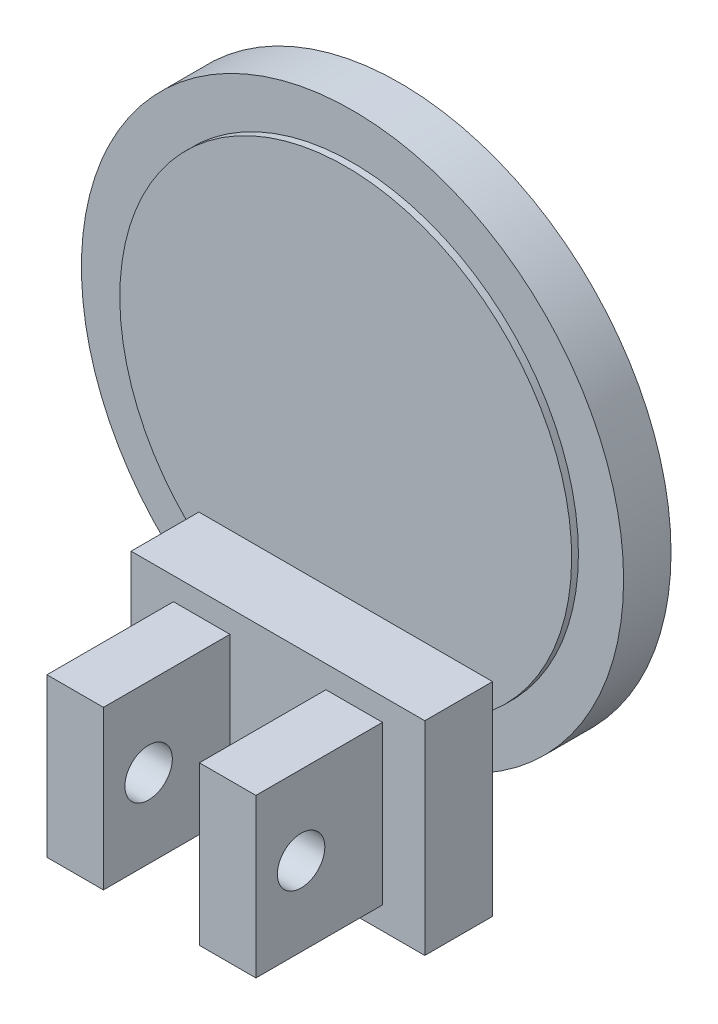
ISO-10303-21;
HEADER;
FILE_DESCRIPTION(('STEP AP214'),'2;1');
FILE_NAME('part.step','',(''),(''),'','','');
FILE_SCHEMA(('AUTOMOTIVE_DESIGN { 1 0 10303 214 1 1 1 1 }'));
ENDSEC;
DATA;
#1=APPLICATION_CONTEXT('core data for automotive mechanical design processes');
#2=APPLICATION_PROTOCOL_DEFINITION('international standard','automotive_design',2000,#1);
#3=PRODUCT_CONTEXT('',#1,'mechanical');
#4=PRODUCT('Part','Part','',(#3));
#5=PRODUCT_RELATED_PRODUCT_CATEGORY('part','',(#4));
#6=PRODUCT_DEFINITION_FORMATION('','',#4);
#7=PRODUCT_DEFINITION_CONTEXT('part definition',#1,'design');
#8=PRODUCT_DEFINITION('design','',#6,#7);
#9=PRODUCT_DEFINITION_SHAPE('','',#8);
#10=(LENGTH_UNIT() NAMED_UNIT(*) SI_UNIT(.MILLI.,.METRE.));
#11=(NAMED_UNIT(*) PLANE_ANGLE_UNIT() SI_UNIT($,.RADIAN.));
#12=(NAMED_UNIT(*) SI_UNIT($,.STERADIAN.) SOLID_ANGLE_UNIT());
#13=UNCERTAINTY_MEASURE_WITH_UNIT(LENGTH_MEASURE(1.E-05),#10,'distance_accuracy_value','');
#14=(GEOMETRIC_REPRESENTATION_CONTEXT(3) GLOBAL_UNCERTAINTY_ASSIGNED_CONTEXT((#13)) GLOBAL_UNIT_ASSIGNED_CONTEXT((#10,
#11,#12)) REPRESENTATION_CONTEXT('',''));
#15=CARTESIAN_POINT('',(0.,0.,0.));
#16=DIRECTION('',(0.,0.,1.));
#17=DIRECTION('',(1.,0.,0.));
#18=AXIS2_PLACEMENT_3D('',#15,#16,#17);
#19=CARTESIAN_POINT('',(0.,0.,4.2));
#20=DIRECTION('',(0.,0.,-1.));
#21=DIRECTION('',(-1.,0.,0.));
#22=AXIS2_PLACEMENT_3D('',#19,#20,#21);
#23=CYLINDRICAL_SURFACE('',#22,24.);
#24=CARTESIAN_POINT('',(0.,0.,4.2));
#25=DIRECTION('',(0.,0.,1.));
#26=DIRECTION('',(1.,0.,0.));
#27=AXIS2_PLACEMENT_3D('',#24,#25,#26);
#28=CIRCLE('',#27,24.);
#29=CARTESIAN_POINT('',(24.,0.,4.2));
#30=VERTEX_POINT('',#29);
#31=EDGE_CURVE('E245',#30,#30,#28,.T.);
#32=ORIENTED_EDGE('',*,*,#31,.F.);
#33=EDGE_LOOP('',(#32));
#34=FACE_BOUND('',#33,.T.);
#35=CARTESIAN_POINT('',(0.,0.,0.));
#36=DIRECTION('',(0.,0.,1.));
#37=DIRECTION('',(1.,0.,0.));
#38=AXIS2_PLACEMENT_3D('',#35,#36,#37);
#39=CIRCLE('',#38,24.);
#40=CARTESIAN_POINT('',(24.,0.,0.));
#41=VERTEX_POINT('',#40);
#42=EDGE_CURVE('E241',#41,#41,#39,.T.);
#43=ORIENTED_EDGE('',*,*,#42,.T.);
#44=EDGE_LOOP('',(#43));
#45=FACE_BOUND('',#44,.T.);
#46=ADVANCED_FACE('F39',(#34,#45),#23,.T.);
#47=CARTESIAN_POINT('',(0.,0.,4.2));
#48=DIRECTION('',(0.,0.,1.));
#49=DIRECTION('',(1.,0.,0.));
#50=AXIS2_PLACEMENT_3D('',#47,#48,#49);
#51=PLANE('',#50);
#52=CARTESIAN_POINT('',(0.,0.,4.2));
#53=DIRECTION('',(0.,0.,1.));
#54=DIRECTION('',(1.,0.,0.));
#55=AXIS2_PLACEMENT_3D('',#52,#53,#54);
#56=CIRCLE('',#55,20.);
#57=CARTESIAN_POINT('',(20.,0.,4.2));
#58=VERTEX_POINT('',#57);
#59=EDGE_CURVE('E242',#58,#58,#56,.T.);
#60=ORIENTED_EDGE('',*,*,#59,.F.);
#61=EDGE_LOOP('',(#60));
#62=FACE_BOUND('',#61,.T.);
#63=ORIENTED_EDGE('',*,*,#31,.T.);
#64=EDGE_LOOP('',(#63));
#65=FACE_BOUND('',#64,.T.);
#66=ADVANCED_FACE('F315',(#62,#65),#51,.T.);
#67=CARTESIAN_POINT('',(0.,0.,0.));
#68=DIRECTION('',(0.,0.,1.));
#69=DIRECTION('',(1.,0.,0.));
#70=AXIS2_PLACEMENT_3D('',#67,#68,#69);
#71=PLANE('',#70);
#72=ORIENTED_EDGE('',*,*,#42,.F.);
#73=EDGE_LOOP('',(#72));
#74=FACE_BOUND('',#73,.T.);
#75=ADVANCED_FACE('F320',(#74),#71,.F.);
#76=CARTESIAN_POINT('',(0.,0.,4.8));
#77=DIRECTION('',(0.,0.,-1.));
#78=DIRECTION('',(-1.,0.,0.));
#79=AXIS2_PLACEMENT_3D('',#76,#77,#78);
#80=CYLINDRICAL_SURFACE('',#79,20.);
#81=CARTESIAN_POINT('',(0.,0.,4.8));
#82=DIRECTION('',(0.,0.,1.));
#83=DIRECTION('',(1.,0.,0.));
#84=AXIS2_PLACEMENT_3D('',#81,#82,#83);
#85=CIRCLE('',#84,20.);
#86=CARTESIAN_POINT('',(-13.,-15.1986841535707,4.8));
#87=VERTEX_POINT('',#86);
#88=CARTESIAN_POINT('',(13.,-15.1986841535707,4.8));
#89=VERTEX_POINT('',#88);
#90=EDGE_CURVE('E239',#87,#89,#85,.T.);
#91=ORIENTED_EDGE('',*,*,#90,.F.);
#92=EDGE_CURVE('E233',#89,#87,#85,.T.);
#93=ORIENTED_EDGE('',*,*,#92,.F.);
#94=EDGE_LOOP('',(#91,#93));
#95=FACE_BOUND('',#94,.T.);
#96=ORIENTED_EDGE('',*,*,#59,.T.);
#97=EDGE_LOOP('',(#96));
#98=FACE_BOUND('',#97,.T.);
#99=ADVANCED_FACE('F297',(#95,#98),#80,.T.);
#100=CARTESIAN_POINT('',(0.,0.,4.8));
#101=DIRECTION('',(0.,0.,1.));
#102=DIRECTION('',(1.,0.,0.));
#103=AXIS2_PLACEMENT_3D('',#100,#101,#102);
#104=PLANE('',#103);
#105=DIRECTION('',(0.,1.,0.));
#106=VECTOR('',#105,1.);
#107=CARTESIAN_POINT('',(13.,-31.,4.8));
#108=LINE('',#107,#106);
#109=CARTESIAN_POINT('',(13.,-13.,4.8));
#110=VERTEX_POINT('',#109);
#111=EDGE_CURVE('E11',#89,#110,#108,.T.);
#112=ORIENTED_EDGE('',*,*,#111,.F.);
#113=ORIENTED_EDGE('',*,*,#92,.T.);
#114=DIRECTION('',(0.,1.,0.));
#115=VECTOR('',#114,1.);
#116=CARTESIAN_POINT('',(-13.,-31.,4.8));
#117=LINE('',#116,#115);
#118=CARTESIAN_POINT('',(-13.,-13.,4.8));
#119=VERTEX_POINT('',#118);
#120=EDGE_CURVE('E47',#87,#119,#117,.T.);
#121=ORIENTED_EDGE('',*,*,#120,.T.);
#122=DIRECTION('',(-1.,0.,0.));
#123=VECTOR('',#122,1.);
#124=CARTESIAN_POINT('',(-13.,-13.,4.8));
#125=LINE('',#124,#123);
#126=EDGE_CURVE('E212',#110,#119,#125,.T.);
#127=ORIENTED_EDGE('',*,*,#126,.F.);
#128=EDGE_LOOP('',(#112,#113,#121,#127));
#129=FACE_BOUND('',#128,.T.);
#130=ADVANCED_FACE('F293',(#129),#104,.T.);
#131=CARTESIAN_POINT('',(-13.,-31.,10.8));
#132=DIRECTION('',(-1.,0.,0.));
#133=DIRECTION('',(0.,0.,1.));
#134=AXIS2_PLACEMENT_3D('',#131,#132,#133);
#135=PLANE('',#134);
#136=DIRECTION('',(0.,0.,1.));
#137=VECTOR('',#136,1.);
#138=CARTESIAN_POINT('',(-13.,-13.,10.8));
#139=LINE('',#138,#137);
#140=CARTESIAN_POINT('',(-13.,-13.,10.8));
#141=VERTEX_POINT('',#140);
#142=EDGE_CURVE('E202',#119,#141,#139,.T.);
#143=ORIENTED_EDGE('',*,*,#142,.F.);
#144=ORIENTED_EDGE('',*,*,#120,.F.);
#145=CARTESIAN_POINT('',(-13.,-31.,4.8));
#146=VERTEX_POINT('',#145);
#147=EDGE_CURVE('E231',#146,#87,#117,.T.);
#148=ORIENTED_EDGE('',*,*,#147,.F.);
#149=DIRECTION('',(0.,0.,1.));
#150=VECTOR('',#149,1.);
#151=CARTESIAN_POINT('',(-13.,-31.,10.8));
#152=LINE('',#151,#150);
#153=CARTESIAN_POINT('',(-13.,-31.,10.8));
#154=VERTEX_POINT('',#153);
#155=EDGE_CURVE('E208',#146,#154,#152,.T.);
#156=ORIENTED_EDGE('',*,*,#155,.T.);
#157=DIRECTION('',(0.,1.,0.));
#158=VECTOR('',#157,1.);
#159=CARTESIAN_POINT('',(-13.,-31.,10.8));
#160=LINE('',#159,#158);
#161=EDGE_CURVE('E221',#154,#141,#160,.T.);
#162=ORIENTED_EDGE('',*,*,#161,.T.);
#163=EDGE_LOOP('',(#143,#144,#148,#156,#162));
#164=FACE_BOUND('',#163,.T.);
#165=ADVANCED_FACE('F289',(#164),#135,.T.);
#166=CARTESIAN_POINT('',(-13.,-31.,4.8));
#167=DIRECTION('',(0.,0.,-1.));
#168=DIRECTION('',(-1.,0.,0.));
#169=AXIS2_PLACEMENT_3D('',#166,#167,#168);
#170=PLANE('',#169);
#171=ORIENTED_EDGE('',*,*,#147,.T.);
#172=ORIENTED_EDGE('',*,*,#90,.T.);
#173=CARTESIAN_POINT('',(13.,-31.,4.8));
#174=VERTEX_POINT('',#173);
#175=EDGE_CURVE('E49',#174,#89,#108,.T.);
#176=ORIENTED_EDGE('',*,*,#175,.F.);
#177=DIRECTION('',(-1.,0.,0.));
#178=VECTOR('',#177,1.);
#179=CARTESIAN_POINT('',(-13.,-31.,4.8));
#180=LINE('',#179,#178);
#181=EDGE_CURVE('E218',#174,#146,#180,.T.);
#182=ORIENTED_EDGE('',*,*,#181,.T.);
#183=EDGE_LOOP('',(#171,#172,#176,#182));
#184=FACE_BOUND('',#183,.T.);
#185=ADVANCED_FACE('F300',(#184),#170,.T.);
#186=CARTESIAN_POINT('',(13.,-31.,10.8));
#187=DIRECTION('',(1.,0.,0.));
#188=DIRECTION('',(0.,0.,-1.));
#189=AXIS2_PLACEMENT_3D('',#186,#187,#188);
#190=PLANE('',#189);
#191=DIRECTION('',(0.,0.,-1.));
#192=VECTOR('',#191,1.);
#193=CARTESIAN_POINT('',(13.,-13.,10.8));
#194=LINE('',#193,#192);
#195=CARTESIAN_POINT('',(13.,-13.,10.8));
#196=VERTEX_POINT('',#195);
#197=EDGE_CURVE('E227',#196,#110,#194,.T.);
#198=ORIENTED_EDGE('',*,*,#197,.F.);
#199=DIRECTION('',(0.,1.,0.));
#200=VECTOR('',#199,1.);
#201=CARTESIAN_POINT('',(13.,-31.,10.8));
#202=LINE('',#201,#200);
#203=CARTESIAN_POINT('',(13.,-31.,10.8));
#204=VERTEX_POINT('',#203);
#205=EDGE_CURVE('E236',#204,#196,#202,.T.);
#206=ORIENTED_EDGE('',*,*,#205,.F.);
#207=DIRECTION('',(0.,0.,-1.));
#208=VECTOR('',#207,1.);
#209=CARTESIAN_POINT('',(13.,-31.,10.8));
#210=LINE('',#209,#208);
#211=EDGE_CURVE('E215',#204,#174,#210,.T.);
#212=ORIENTED_EDGE('',*,*,#211,.T.);
#213=ORIENTED_EDGE('',*,*,#175,.T.);
#214=ORIENTED_EDGE('',*,*,#111,.T.);
#215=EDGE_LOOP('',(#198,#206,#212,#213,#214));
#216=FACE_BOUND('',#215,.T.);
#217=ADVANCED_FACE('F275',(#216),#190,.T.);
#218=CARTESIAN_POINT('',(-13.,-31.,10.8));
#219=DIRECTION('',(0.,0.,1.));
#220=DIRECTION('',(1.,0.,0.));
#221=AXIS2_PLACEMENT_3D('',#218,#219,#220);
#222=PLANE('',#221);
#223=DIRECTION('',(-1.,0.,0.));
#224=VECTOR('',#223,1.);
#225=CARTESIAN_POINT('',(-9.25,-29.,10.8));
#226=LINE('',#225,#224);
#227=CARTESIAN_POINT('',(-4.25,-29.,10.8));
#228=VERTEX_POINT('',#227);
#229=CARTESIAN_POINT('',(-9.25,-29.,10.8));
#230=VERTEX_POINT('',#229);
#231=EDGE_CURVE('E148',#228,#230,#226,.T.);
#232=ORIENTED_EDGE('',*,*,#231,.T.);
#233=DIRECTION('',(0.,1.,0.));
#234=VECTOR('',#233,1.);
#235=CARTESIAN_POINT('',(-9.25,-29.,10.8));
#236=LINE('',#235,#234);
#237=CARTESIAN_POINT('',(-9.25,-15.,10.8));
#238=VERTEX_POINT('',#237);
#239=EDGE_CURVE('E161',#230,#238,#236,.T.);
#240=ORIENTED_EDGE('',*,*,#239,.T.);
#241=DIRECTION('',(-1.,0.,0.));
#242=VECTOR('',#241,1.);
#243=CARTESIAN_POINT('',(-9.25,-15.,10.8));
#244=LINE('',#243,#242);
#245=CARTESIAN_POINT('',(-4.25,-15.,10.8));
#246=VERTEX_POINT('',#245);
#247=EDGE_CURVE('E162',#246,#238,#244,.T.);
#248=ORIENTED_EDGE('',*,*,#247,.F.);
#249=DIRECTION('',(0.,1.,0.));
#250=VECTOR('',#249,1.);
#251=CARTESIAN_POINT('',(-4.25,-29.,10.8));
#252=LINE('',#251,#250);
#253=EDGE_CURVE('E177',#228,#246,#252,.T.);
#254=ORIENTED_EDGE('',*,*,#253,.F.);
#255=EDGE_LOOP('',(#232,#240,#248,#254));
#256=FACE_BOUND('',#255,.T.);
#257=DIRECTION('',(-1.,0.,0.));
#258=VECTOR('',#257,1.);
#259=CARTESIAN_POINT('',(4.25,-29.,10.8));
#260=LINE('',#259,#258);
#261=CARTESIAN_POINT('',(9.24999999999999,-29.,10.8));
#262=VERTEX_POINT('',#261);
#263=CARTESIAN_POINT('',(4.25,-29.,10.8));
#264=VERTEX_POINT('',#263);
#265=EDGE_CURVE('E189',#262,#264,#260,.T.);
#266=ORIENTED_EDGE('',*,*,#265,.T.);
#267=DIRECTION('',(0.,1.,0.));
#268=VECTOR('',#267,1.);
#269=CARTESIAN_POINT('',(4.25,-29.,10.8));
#270=LINE('',#269,#268);
#271=CARTESIAN_POINT('',(4.25,-15.,10.8));
#272=VERTEX_POINT('',#271);
#273=EDGE_CURVE('E199',#264,#272,#270,.T.);
#274=ORIENTED_EDGE('',*,*,#273,.T.);
#275=DIRECTION('',(-1.,0.,0.));
#276=VECTOR('',#275,1.);
#277=CARTESIAN_POINT('',(4.25,-15.,10.8));
#278=LINE('',#277,#276);
#279=CARTESIAN_POINT('',(9.24999999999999,-15.,10.8));
#280=VERTEX_POINT('',#279);
#281=EDGE_CURVE('E184',#280,#272,#278,.T.);
#282=ORIENTED_EDGE('',*,*,#281,.F.);
#283=DIRECTION('',(0.,1.,0.));
#284=VECTOR('',#283,1.);
#285=CARTESIAN_POINT('',(9.24999999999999,-29.,10.8));
#286=LINE('',#285,#284);
#287=EDGE_CURVE('E203',#262,#280,#286,.T.);
#288=ORIENTED_EDGE('',*,*,#287,.F.);
#289=EDGE_LOOP('',(#266,#274,#282,#288));
#290=FACE_BOUND('',#289,.T.);
#291=DIRECTION('',(1.,0.,0.));
#292=VECTOR('',#291,1.);
#293=CARTESIAN_POINT('',(-13.,-13.,10.8));
#294=LINE('',#293,#292);
#295=EDGE_CURVE('E224',#141,#196,#294,.T.);
#296=ORIENTED_EDGE('',*,*,#295,.F.);
#297=ORIENTED_EDGE('',*,*,#161,.F.);
#298=DIRECTION('',(1.,0.,0.));
#299=VECTOR('',#298,1.);
#300=CARTESIAN_POINT('',(-13.,-31.,10.8));
#301=LINE('',#300,#299);
#302=EDGE_CURVE('E211',#154,#204,#301,.T.);
#303=ORIENTED_EDGE('',*,*,#302,.T.);
#304=ORIENTED_EDGE('',*,*,#205,.T.);
#305=EDGE_LOOP('',(#296,#297,#303,#304));
#306=FACE_BOUND('',#305,.T.);
#307=ADVANCED_FACE('F271',(#256,#290,#306),#222,.T.);
#308=CARTESIAN_POINT('',(0.,-31.,0.));
#309=DIRECTION('',(0.,-1.,0.));
#310=DIRECTION('',(0.,0.,-1.));
#311=AXIS2_PLACEMENT_3D('',#308,#309,#310);
#312=PLANE('',#311);
#313=ORIENTED_EDGE('',*,*,#155,.F.);
#314=ORIENTED_EDGE('',*,*,#181,.F.);
#315=ORIENTED_EDGE('',*,*,#211,.F.);
#316=ORIENTED_EDGE('',*,*,#302,.F.);
#317=EDGE_LOOP('',(#313,#314,#315,#316));
#318=FACE_BOUND('',#317,.T.);
#319=ADVANCED_FACE('F274',(#318),#312,.T.);
#320=CARTESIAN_POINT('',(0.,-13.,0.));
#321=DIRECTION('',(0.,-1.,0.));
#322=DIRECTION('',(0.,0.,-1.));
#323=AXIS2_PLACEMENT_3D('',#320,#321,#322);
#324=PLANE('',#323);
#325=ORIENTED_EDGE('',*,*,#142,.T.);
#326=ORIENTED_EDGE('',*,*,#295,.T.);
#327=ORIENTED_EDGE('',*,*,#197,.T.);
#328=ORIENTED_EDGE('',*,*,#126,.T.);
#329=EDGE_LOOP('',(#325,#326,#327,#328));
#330=FACE_BOUND('',#329,.T.);
#331=ADVANCED_FACE('F285',(#330),#324,.F.);
#332=CARTESIAN_POINT('',(4.25,-29.,22.));
#333=DIRECTION('',(-1.,0.,0.));
#334=DIRECTION('',(0.,0.,1.));
#335=AXIS2_PLACEMENT_3D('',#332,#333,#334);
#336=PLANE('',#335);
#337=CARTESIAN_POINT('',(4.25,-22.,18.));
#338=DIRECTION('',(-1.,0.,0.));
#339=DIRECTION('',(0.,0.,1.));
#340=AXIS2_PLACEMENT_3D('',#337,#338,#339);
#341=CIRCLE('',#340,2.1);
#342=CARTESIAN_POINT('',(4.25,-22.,20.1));
#343=VERTEX_POINT('',#342);
#344=EDGE_CURVE('E166',#343,#343,#341,.F.);
#345=ORIENTED_EDGE('',*,*,#344,.T.);
#346=EDGE_LOOP('',(#345));
#347=FACE_BOUND('',#346,.T.);
#348=DIRECTION('',(0.,0.,1.));
#349=VECTOR('',#348,1.);
#350=CARTESIAN_POINT('',(4.25,-15.,22.));
#351=LINE('',#350,#349);
#352=CARTESIAN_POINT('',(4.25,-15.,22.));
#353=VERTEX_POINT('',#352);
#354=EDGE_CURVE('E176',#272,#353,#351,.T.);
#355=ORIENTED_EDGE('',*,*,#354,.F.);
#356=ORIENTED_EDGE('',*,*,#273,.F.);
#357=DIRECTION('',(0.,0.,1.));
#358=VECTOR('',#357,1.);
#359=CARTESIAN_POINT('',(4.25,-29.,22.));
#360=LINE('',#359,#358);
#361=CARTESIAN_POINT('',(4.25,-29.,22.));
#362=VERTEX_POINT('',#361);
#363=EDGE_CURVE('E180',#264,#362,#360,.T.);
#364=ORIENTED_EDGE('',*,*,#363,.T.);
#365=DIRECTION('',(0.,1.,0.));
#366=VECTOR('',#365,1.);
#367=CARTESIAN_POINT('',(4.25,-29.,22.));
#368=LINE('',#367,#366);
#369=EDGE_CURVE('E192',#362,#353,#368,.T.);
#370=ORIENTED_EDGE('',*,*,#369,.T.);
#371=EDGE_LOOP('',(#355,#356,#364,#370));
#372=FACE_BOUND('',#371,.T.);
#373=ADVANCED_FACE('F311',(#347,#372),#336,.T.);
#374=CARTESIAN_POINT('',(9.24999999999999,-29.,22.));
#375=DIRECTION('',(1.,0.,0.));
#376=DIRECTION('',(0.,0.,-1.));
#377=AXIS2_PLACEMENT_3D('',#374,#375,#376);
#378=PLANE('',#377);
#379=CARTESIAN_POINT('',(9.24999999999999,-22.,18.));
#380=DIRECTION('',(1.,0.,0.));
#381=DIRECTION('',(0.,0.,-1.));
#382=AXIS2_PLACEMENT_3D('',#379,#380,#381);
#383=CIRCLE('',#382,2.1);
#384=CARTESIAN_POINT('',(9.24999999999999,-22.,15.9));
#385=VERTEX_POINT('',#384);
#386=EDGE_CURVE('E249',#385,#385,#383,.F.);
#387=ORIENTED_EDGE('',*,*,#386,.T.);
#388=EDGE_LOOP('',(#387));
#389=FACE_BOUND('',#388,.T.);
#390=DIRECTION('',(0.,0.,-1.));
#391=VECTOR('',#390,1.);
#392=CARTESIAN_POINT('',(9.24999999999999,-15.,22.));
#393=LINE('',#392,#391);
#394=CARTESIAN_POINT('',(9.24999999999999,-15.,22.));
#395=VERTEX_POINT('',#394);
#396=EDGE_CURVE('E64',#395,#280,#393,.T.);
#397=ORIENTED_EDGE('',*,*,#396,.F.);
#398=DIRECTION('',(0.,1.,0.));
#399=VECTOR('',#398,1.);
#400=CARTESIAN_POINT('',(9.24999999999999,-29.,22.));
#401=LINE('',#400,#399);
#402=CARTESIAN_POINT('',(9.24999999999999,-29.,22.));
#403=VERTEX_POINT('',#402);
#404=EDGE_CURVE('E205',#403,#395,#401,.T.);
#405=ORIENTED_EDGE('',*,*,#404,.F.);
#406=DIRECTION('',(0.,0.,-1.));
#407=VECTOR('',#406,1.);
#408=CARTESIAN_POINT('',(9.24999999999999,-29.,22.));
#409=LINE('',#408,#407);
#410=EDGE_CURVE('E187',#403,#262,#409,.T.);
#411=ORIENTED_EDGE('',*,*,#410,.T.);
#412=ORIENTED_EDGE('',*,*,#287,.T.);
#413=EDGE_LOOP('',(#397,#405,#411,#412));
#414=FACE_BOUND('',#413,.T.);
#415=ADVANCED_FACE('F400',(#389,#414),#378,.T.);
#416=CARTESIAN_POINT('',(4.25,-29.,22.));
#417=DIRECTION('',(0.,0.,1.));
#418=DIRECTION('',(1.,0.,0.));
#419=AXIS2_PLACEMENT_3D('',#416,#417,#418);
#420=PLANE('',#419);
#421=DIRECTION('',(1.,0.,0.));
#422=VECTOR('',#421,1.);
#423=CARTESIAN_POINT('',(4.25,-15.,22.));
#424=LINE('',#423,#422);
#425=EDGE_CURVE('E195',#353,#395,#424,.T.);
#426=ORIENTED_EDGE('',*,*,#425,.F.);
#427=ORIENTED_EDGE('',*,*,#369,.F.);
#428=DIRECTION('',(1.,0.,0.));
#429=VECTOR('',#428,1.);
#430=CARTESIAN_POINT('',(4.25,-29.,22.));
#431=LINE('',#430,#429);
#432=EDGE_CURVE('E183',#362,#403,#431,.T.);
#433=ORIENTED_EDGE('',*,*,#432,.T.);
#434=ORIENTED_EDGE('',*,*,#404,.T.);
#435=EDGE_LOOP('',(#426,#427,#433,#434));
#436=FACE_BOUND('',#435,.T.);
#437=ADVANCED_FACE('F411',(#436),#420,.T.);
#438=CARTESIAN_POINT('',(0.,-29.,0.));
#439=DIRECTION('',(0.,-1.,0.));
#440=DIRECTION('',(0.,0.,-1.));
#441=AXIS2_PLACEMENT_3D('',#438,#439,#440);
#442=PLANE('',#441);
#443=ORIENTED_EDGE('',*,*,#363,.F.);
#444=ORIENTED_EDGE('',*,*,#265,.F.);
#445=ORIENTED_EDGE('',*,*,#410,.F.);
#446=ORIENTED_EDGE('',*,*,#432,.F.);
#447=EDGE_LOOP('',(#443,#444,#445,#446));
#448=FACE_BOUND('',#447,.T.);
#449=ADVANCED_FACE('F461',(#448),#442,.T.);
#450=CARTESIAN_POINT('',(0.,-15.,0.));
#451=DIRECTION('',(0.,-1.,0.));
#452=DIRECTION('',(0.,0.,-1.));
#453=AXIS2_PLACEMENT_3D('',#450,#451,#452);
#454=PLANE('',#453);
#455=ORIENTED_EDGE('',*,*,#354,.T.);
#456=ORIENTED_EDGE('',*,*,#425,.T.);
#457=ORIENTED_EDGE('',*,*,#396,.T.);
#458=ORIENTED_EDGE('',*,*,#281,.T.);
#459=EDGE_LOOP('',(#455,#456,#457,#458));
#460=FACE_BOUND('',#459,.T.);
#461=ADVANCED_FACE('F360',(#460),#454,.F.);
#462=CARTESIAN_POINT('',(-9.25,-29.,22.));
#463=DIRECTION('',(-1.,0.,0.));
#464=DIRECTION('',(0.,0.,1.));
#465=AXIS2_PLACEMENT_3D('',#462,#463,#464);
#466=PLANE('',#465);
#467=CARTESIAN_POINT('',(-9.25,-22.,18.));
#468=DIRECTION('',(-1.,0.,0.));
#469=DIRECTION('',(0.,0.,1.));
#470=AXIS2_PLACEMENT_3D('',#467,#468,#469);
#471=CIRCLE('',#470,2.1);
#472=CARTESIAN_POINT('',(-9.25,-22.,20.1));
#473=VERTEX_POINT('',#472);
#474=EDGE_CURVE('E251',#473,#473,#471,.T.);
#475=ORIENTED_EDGE('',*,*,#474,.F.);
#476=EDGE_LOOP('',(#475));
#477=FACE_BOUND('',#476,.T.);
#478=DIRECTION('',(0.,0.,1.));
#479=VECTOR('',#478,1.);
#480=CARTESIAN_POINT('',(-9.25,-15.,22.));
#481=LINE('',#480,#479);
#482=CARTESIAN_POINT('',(-9.25,-15.,22.));
#483=VERTEX_POINT('',#482);
#484=EDGE_CURVE('E171',#238,#483,#481,.T.);
#485=ORIENTED_EDGE('',*,*,#484,.F.);
#486=ORIENTED_EDGE('',*,*,#239,.F.);
#487=DIRECTION('',(0.,0.,1.));
#488=VECTOR('',#487,1.);
#489=CARTESIAN_POINT('',(-9.25,-29.,22.));
#490=LINE('',#489,#488);
#491=CARTESIAN_POINT('',(-9.25,-29.,22.));
#492=VERTEX_POINT('',#491);
#493=EDGE_CURVE('E155',#230,#492,#490,.T.);
#494=ORIENTED_EDGE('',*,*,#493,.T.);
#495=DIRECTION('',(0.,1.,0.));
#496=VECTOR('',#495,1.);
#497=CARTESIAN_POINT('',(-9.25,-29.,22.));
#498=LINE('',#497,#496);
#499=EDGE_CURVE('E139',#492,#483,#498,.T.);
#500=ORIENTED_EDGE('',*,*,#499,.T.);
#501=EDGE_LOOP('',(#485,#486,#494,#500));
#502=FACE_BOUND('',#501,.T.);
#503=ADVANCED_FACE('F159',(#477,#502),#466,.T.);
#504=CARTESIAN_POINT('',(-4.25,-29.,22.));
#505=DIRECTION('',(1.,0.,0.));
#506=DIRECTION('',(0.,0.,-1.));
#507=AXIS2_PLACEMENT_3D('',#504,#505,#506);
#508=PLANE('',#507);
#509=CARTESIAN_POINT('',(-4.25,-22.,18.));
#510=DIRECTION('',(1.,0.,0.));
#511=DIRECTION('',(0.,0.,-1.));
#512=AXIS2_PLACEMENT_3D('',#509,#510,#511);
#513=CIRCLE('',#512,2.1);
#514=CARTESIAN_POINT('',(-4.25,-22.,15.9));
#515=VERTEX_POINT('',#514);
#516=EDGE_CURVE('E42',#515,#515,#513,.T.);
#517=ORIENTED_EDGE('',*,*,#516,.F.);
#518=EDGE_LOOP('',(#517));
#519=FACE_BOUND('',#518,.T.);
#520=DIRECTION('',(0.,0.,-1.));
#521=VECTOR('',#520,1.);
#522=CARTESIAN_POINT('',(-4.25,-15.,22.));
#523=LINE('',#522,#521);
#524=CARTESIAN_POINT('',(-4.25,-15.,22.));
#525=VERTEX_POINT('',#524);
#526=EDGE_CURVE('E56',#525,#246,#523,.T.);
#527=ORIENTED_EDGE('',*,*,#526,.F.);
#528=DIRECTION('',(0.,1.,0.));
#529=VECTOR('',#528,1.);
#530=CARTESIAN_POINT('',(-4.25,-29.,22.));
#531=LINE('',#530,#529);
#532=CARTESIAN_POINT('',(-4.25,-29.,22.));
#533=VERTEX_POINT('',#532);
#534=EDGE_CURVE('E147',#533,#525,#531,.T.);
#535=ORIENTED_EDGE('',*,*,#534,.F.);
#536=DIRECTION('',(0.,0.,-1.));
#537=VECTOR('',#536,1.);
#538=CARTESIAN_POINT('',(-4.25,-29.,22.));
#539=LINE('',#538,#537);
#540=EDGE_CURVE('E157',#533,#228,#539,.T.);
#541=ORIENTED_EDGE('',*,*,#540,.T.);
#542=ORIENTED_EDGE('',*,*,#253,.T.);
#543=EDGE_LOOP('',(#527,#535,#541,#542));
#544=FACE_BOUND('',#543,.T.);
#545=ADVANCED_FACE('F263',(#519,#544),#508,.T.);
#546=CARTESIAN_POINT('',(-9.25,-29.,22.));
#547=DIRECTION('',(0.,0.,1.));
#548=DIRECTION('',(1.,0.,0.));
#549=AXIS2_PLACEMENT_3D('',#546,#547,#548);
#550=PLANE('',#549);
#551=DIRECTION('',(1.,0.,0.));
#552=VECTOR('',#551,1.);
#553=CARTESIAN_POINT('',(-9.25,-15.,22.));
#554=LINE('',#553,#552);
#555=EDGE_CURVE('E143',#483,#525,#554,.T.);
#556=ORIENTED_EDGE('',*,*,#555,.F.);
#557=ORIENTED_EDGE('',*,*,#499,.F.);
#558=DIRECTION('',(1.,0.,0.));
#559=VECTOR('',#558,1.);
#560=CARTESIAN_POINT('',(-9.25,-29.,22.));
#561=LINE('',#560,#559);
#562=EDGE_CURVE('E142',#492,#533,#561,.T.);
#563=ORIENTED_EDGE('',*,*,#562,.T.);
#564=ORIENTED_EDGE('',*,*,#534,.T.);
#565=EDGE_LOOP('',(#556,#557,#563,#564));
#566=FACE_BOUND('',#565,.T.);
#567=ADVANCED_FACE('F141',(#566),#550,.T.);
#568=CARTESIAN_POINT('',(0.,-29.,0.));
#569=DIRECTION('',(0.,-1.,0.));
#570=DIRECTION('',(0.,0.,-1.));
#571=AXIS2_PLACEMENT_3D('',#568,#569,#570);
#572=PLANE('',#571);
#573=ORIENTED_EDGE('',*,*,#493,.F.);
#574=ORIENTED_EDGE('',*,*,#231,.F.);
#575=ORIENTED_EDGE('',*,*,#540,.F.);
#576=ORIENTED_EDGE('',*,*,#562,.F.);
#577=EDGE_LOOP('',(#573,#574,#575,#576));
#578=FACE_BOUND('',#577,.T.);
#579=ADVANCED_FACE('F153',(#578),#572,.T.);
#580=CARTESIAN_POINT('',(0.,-15.,0.));
#581=DIRECTION('',(0.,-1.,0.));
#582=DIRECTION('',(0.,0.,-1.));
#583=AXIS2_PLACEMENT_3D('',#580,#581,#582);
#584=PLANE('',#583);
#585=ORIENTED_EDGE('',*,*,#484,.T.);
#586=ORIENTED_EDGE('',*,*,#555,.T.);
#587=ORIENTED_EDGE('',*,*,#526,.T.);
#588=ORIENTED_EDGE('',*,*,#247,.T.);
#589=EDGE_LOOP('',(#585,#586,#587,#588));
#590=FACE_BOUND('',#589,.T.);
#591=ADVANCED_FACE('F269',(#590),#584,.F.);
#592=CARTESIAN_POINT('',(24.,-22.,18.));
#593=DIRECTION('',(-1.,0.,0.));
#594=DIRECTION('',(0.,0.,1.));
#595=AXIS2_PLACEMENT_3D('',#592,#593,#594);
#596=CYLINDRICAL_SURFACE('',#595,2.1);
#597=ORIENTED_EDGE('',*,*,#344,.F.);
#598=EDGE_LOOP('',(#597));
#599=FACE_BOUND('',#598,.T.);
#600=ORIENTED_EDGE('',*,*,#386,.F.);
#601=EDGE_LOOP('',(#600));
#602=FACE_BOUND('',#601,.T.);
#603=ADVANCED_FACE('F388',(#599,#602),#596,.F.);
#604=CARTESIAN_POINT('',(-24.,-22.,18.));
#605=DIRECTION('',(1.,0.,0.));
#606=DIRECTION('',(0.,0.,-1.));
#607=AXIS2_PLACEMENT_3D('',#604,#605,#606);
#608=CYLINDRICAL_SURFACE('',#607,2.1);
#609=ORIENTED_EDGE('',*,*,#474,.T.);
#610=EDGE_LOOP('',(#609));
#611=FACE_BOUND('',#610,.T.);
#612=ORIENTED_EDGE('',*,*,#516,.T.);
#613=EDGE_LOOP('',(#612));
#614=FACE_BOUND('',#613,.T.);
#615=ADVANCED_FACE('F261',(#611,#614),#608,.F.);
#616=CLOSED_SHELL('',(#46,#66,#75,#99,#130,#165,#185,#217,#307,#319,#331,#373,#415,#437,#449,
#461,#503,#545,#567,#579,#591,#603,#615));
#617=MANIFOLD_SOLID_BREP('B2',#616);
#618=ADVANCED_BREP_SHAPE_REPRESENTATION('',(#18,#617),#14);
#619=SHAPE_DEFINITION_REPRESENTATION(#9,#618);
ENDSEC;
END-ISO-10303-21;
